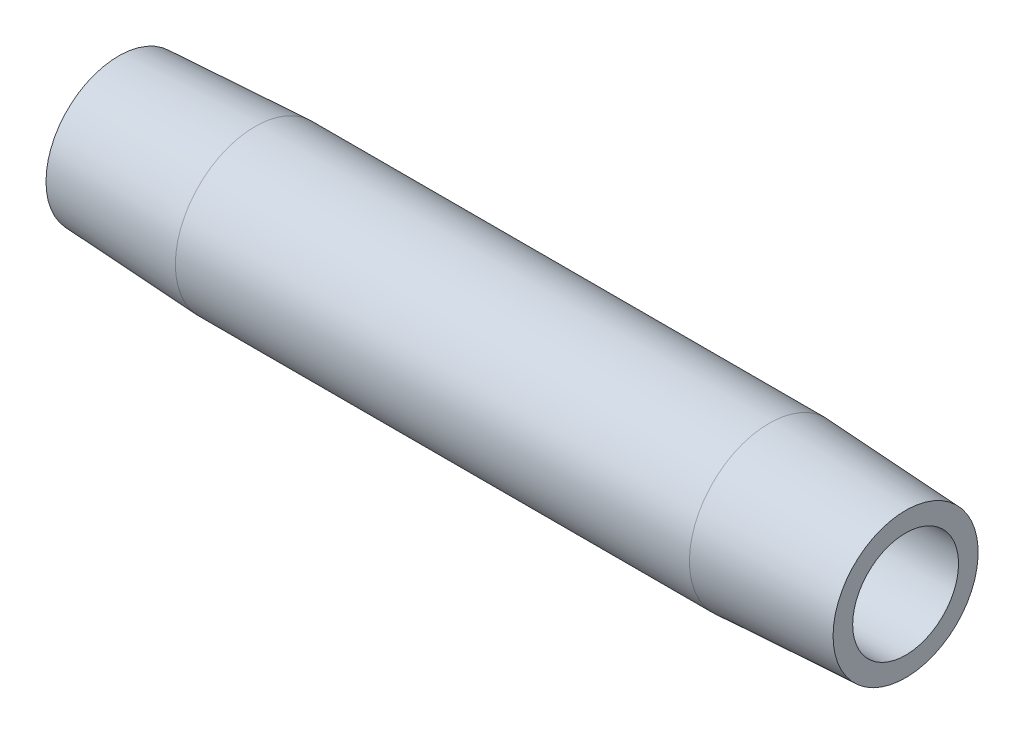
ISO-10303-21;
HEADER;
FILE_DESCRIPTION(('STEP AP214'),'2;1');
FILE_NAME('part.step','',(''),(''),'','','');
FILE_SCHEMA(('AUTOMOTIVE_DESIGN { 1 0 10303 214 1 1 1 1 }'));
ENDSEC;
DATA;
#1=APPLICATION_CONTEXT('core data for automotive mechanical design processes');
#2=APPLICATION_PROTOCOL_DEFINITION('international standard','automotive_design',2000,#1);
#3=PRODUCT_CONTEXT('',#1,'mechanical');
#4=PRODUCT('Part','Part','',(#3));
#5=PRODUCT_RELATED_PRODUCT_CATEGORY('part','',(#4));
#6=PRODUCT_DEFINITION_FORMATION('','',#4);
#7=PRODUCT_DEFINITION_CONTEXT('part definition',#1,'design');
#8=PRODUCT_DEFINITION('design','',#6,#7);
#9=PRODUCT_DEFINITION_SHAPE('','',#8);
#10=(LENGTH_UNIT() NAMED_UNIT(*) SI_UNIT(.MILLI.,.METRE.));
#11=(NAMED_UNIT(*) PLANE_ANGLE_UNIT() SI_UNIT($,.RADIAN.));
#12=(NAMED_UNIT(*) SI_UNIT($,.STERADIAN.) SOLID_ANGLE_UNIT());
#13=UNCERTAINTY_MEASURE_WITH_UNIT(LENGTH_MEASURE(1.E-05),#10,'distance_accuracy_value','');
#14=(GEOMETRIC_REPRESENTATION_CONTEXT(3) GLOBAL_UNCERTAINTY_ASSIGNED_CONTEXT((#13)) GLOBAL_UNIT_ASSIGNED_CONTEXT((#10,
#11,#12)) REPRESENTATION_CONTEXT('',''));
#15=CARTESIAN_POINT('',(0.,0.,0.));
#16=DIRECTION('',(0.,0.,1.));
#17=DIRECTION('',(1.,0.,0.));
#18=AXIS2_PLACEMENT_3D('',#15,#16,#17);
#19=CARTESIAN_POINT('',(0.476141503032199,0.,0.));
#20=DIRECTION('',(-1.,0.,0.));
#21=DIRECTION('',(0.,0.,1.));
#22=AXIS2_PLACEMENT_3D('',#19,#20,#21);
#23=CYLINDRICAL_SURFACE('',#22,5.14349999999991);
#24=CARTESIAN_POINT('',(8.8100393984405,0.,0.));
#25=DIRECTION('',(-1.,0.,0.));
#26=DIRECTION('',(0.,0.,1.));
#27=AXIS2_PLACEMENT_3D('',#24,#25,#26);
#28=CIRCLE('',#27,5.14349999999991);
#29=CARTESIAN_POINT('',(8.8100393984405,0.,5.14349999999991));
#30=VERTEX_POINT('',#29);
#31=EDGE_CURVE('E10',#30,#30,#28,.T.);
#32=ORIENTED_EDGE('',*,*,#31,.F.);
#33=EDGE_LOOP('',(#32));
#34=FACE_BOUND('',#33,.T.);
#35=CARTESIAN_POINT('',(41.9899606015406,0.,0.));
#36=DIRECTION('',(-1.,0.,0.));
#37=DIRECTION('',(0.,0.,1.));
#38=AXIS2_PLACEMENT_3D('',#35,#36,#37);
#39=CIRCLE('',#38,5.14349999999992);
#40=CARTESIAN_POINT('',(41.9899606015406,0.,5.14349999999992));
#41=VERTEX_POINT('',#40);
#42=EDGE_CURVE('E52',#41,#41,#39,.T.);
#43=ORIENTED_EDGE('',*,*,#42,.T.);
#44=EDGE_LOOP('',(#43));
#45=FACE_BOUND('',#44,.T.);
#46=ADVANCED_FACE('F30',(#34,#45),#23,.T.);
#47=CARTESIAN_POINT('',(8.8100393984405,0.,0.));
#48=DIRECTION('',(1.,0.,0.));
#49=DIRECTION('',(0.,0.,-1.));
#50=AXIS2_PLACEMENT_3D('',#47,#48,#49);
#51=CONICAL_SURFACE('',#50,5.14349999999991,0.0523598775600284);
#52=CARTESIAN_POINT('',(0.,0.,0.));
#53=DIRECTION('',(-1.,0.,0.));
#54=DIRECTION('',(0.,0.,1.));
#55=AXIS2_PLACEMENT_3D('',#52,#53,#54);
#56=CIRCLE('',#55,4.68178539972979);
#57=CARTESIAN_POINT('',(0.,0.,4.68178539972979));
#58=VERTEX_POINT('',#57);
#59=EDGE_CURVE('E36',#58,#58,#56,.T.);
#60=ORIENTED_EDGE('',*,*,#59,.F.);
#61=EDGE_LOOP('',(#60));
#62=FACE_BOUND('',#61,.T.);
#63=ORIENTED_EDGE('',*,*,#31,.T.);
#64=EDGE_LOOP('',(#63));
#65=FACE_BOUND('',#64,.T.);
#66=ADVANCED_FACE('F77',(#62,#65),#51,.T.);
#67=CARTESIAN_POINT('',(0.,4.68178539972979,0.));
#68=DIRECTION('',(1.,0.,0.));
#69=DIRECTION('',(0.,0.,-1.));
#70=AXIS2_PLACEMENT_3D('',#67,#68,#69);
#71=PLANE('',#70);
#72=CARTESIAN_POINT('',(0.,0.,0.));
#73=DIRECTION('',(-1.,0.,0.));
#74=DIRECTION('',(0.,0.,1.));
#75=AXIS2_PLACEMENT_3D('',#72,#73,#74);
#76=CIRCLE('',#75,3.4163);
#77=CARTESIAN_POINT('',(0.,0.,3.4163));
#78=VERTEX_POINT('',#77);
#79=EDGE_CURVE('E40',#78,#78,#76,.T.);
#80=ORIENTED_EDGE('',*,*,#79,.F.);
#81=EDGE_LOOP('',(#80));
#82=FACE_BOUND('',#81,.T.);
#83=ORIENTED_EDGE('',*,*,#59,.T.);
#84=EDGE_LOOP('',(#83));
#85=FACE_BOUND('',#84,.T.);
#86=ADVANCED_FACE('F72',(#82,#85),#71,.F.);
#87=CARTESIAN_POINT('',(0.476141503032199,0.,0.));
#88=DIRECTION('',(-1.,0.,0.));
#89=DIRECTION('',(0.,0.,1.));
#90=AXIS2_PLACEMENT_3D('',#87,#88,#89);
#91=CYLINDRICAL_SURFACE('',#90,3.4163);
#92=CARTESIAN_POINT('',(50.8,0.,0.));
#93=DIRECTION('',(-1.,0.,0.));
#94=DIRECTION('',(0.,0.,1.));
#95=AXIS2_PLACEMENT_3D('',#92,#93,#94);
#96=CIRCLE('',#95,3.41630000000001);
#97=CARTESIAN_POINT('',(50.8,0.,3.41630000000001));
#98=VERTEX_POINT('',#97);
#99=EDGE_CURVE('E44',#98,#98,#96,.T.);
#100=ORIENTED_EDGE('',*,*,#99,.F.);
#101=EDGE_LOOP('',(#100));
#102=FACE_BOUND('',#101,.T.);
#103=ORIENTED_EDGE('',*,*,#79,.T.);
#104=EDGE_LOOP('',(#103));
#105=FACE_BOUND('',#104,.T.);
#106=ADVANCED_FACE('F66',(#102,#105),#91,.F.);
#107=CARTESIAN_POINT('',(50.7999999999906,3.41630000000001,0.));
#108=DIRECTION('',(-1.,0.,0.));
#109=DIRECTION('',(0.,0.,1.));
#110=AXIS2_PLACEMENT_3D('',#107,#108,#109);
#111=PLANE('',#110);
#112=CARTESIAN_POINT('',(50.7999999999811,0.,0.));
#113=DIRECTION('',(-1.,0.,0.));
#114=DIRECTION('',(0.,0.,1.));
#115=AXIS2_PLACEMENT_3D('',#112,#113,#114);
#116=CIRCLE('',#115,4.68178539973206);
#117=CARTESIAN_POINT('',(50.7999999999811,0.,4.68178539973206));
#118=VERTEX_POINT('',#117);
#119=EDGE_CURVE('E49',#118,#118,#116,.T.);
#120=ORIENTED_EDGE('',*,*,#119,.F.);
#121=EDGE_LOOP('',(#120));
#122=FACE_BOUND('',#121,.T.);
#123=ORIENTED_EDGE('',*,*,#99,.T.);
#124=EDGE_LOOP('',(#123));
#125=FACE_BOUND('',#124,.T.);
#126=ADVANCED_FACE('F60',(#122,#125),#111,.F.);
#127=CARTESIAN_POINT('',(50.7999999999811,0.,0.));
#128=DIRECTION('',(-1.,0.,0.));
#129=DIRECTION('',(0.,0.,1.));
#130=AXIS2_PLACEMENT_3D('',#127,#128,#129);
#131=CONICAL_SURFACE('',#130,4.68178539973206,0.0523598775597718);
#132=ORIENTED_EDGE('',*,*,#42,.F.);
#133=EDGE_LOOP('',(#132));
#134=FACE_BOUND('',#133,.T.);
#135=ORIENTED_EDGE('',*,*,#119,.T.);
#136=EDGE_LOOP('',(#135));
#137=FACE_BOUND('',#136,.T.);
#138=ADVANCED_FACE('F57',(#134,#137),#131,.T.);
#139=CLOSED_SHELL('',(#46,#66,#86,#106,#126,#138));
#140=MANIFOLD_SOLID_BREP('B2',#139);
#141=ADVANCED_BREP_SHAPE_REPRESENTATION('',(#18,#140),#14);
#142=SHAPE_DEFINITION_REPRESENTATION(#9,#141);
ENDSEC;
END-ISO-10303-21;
